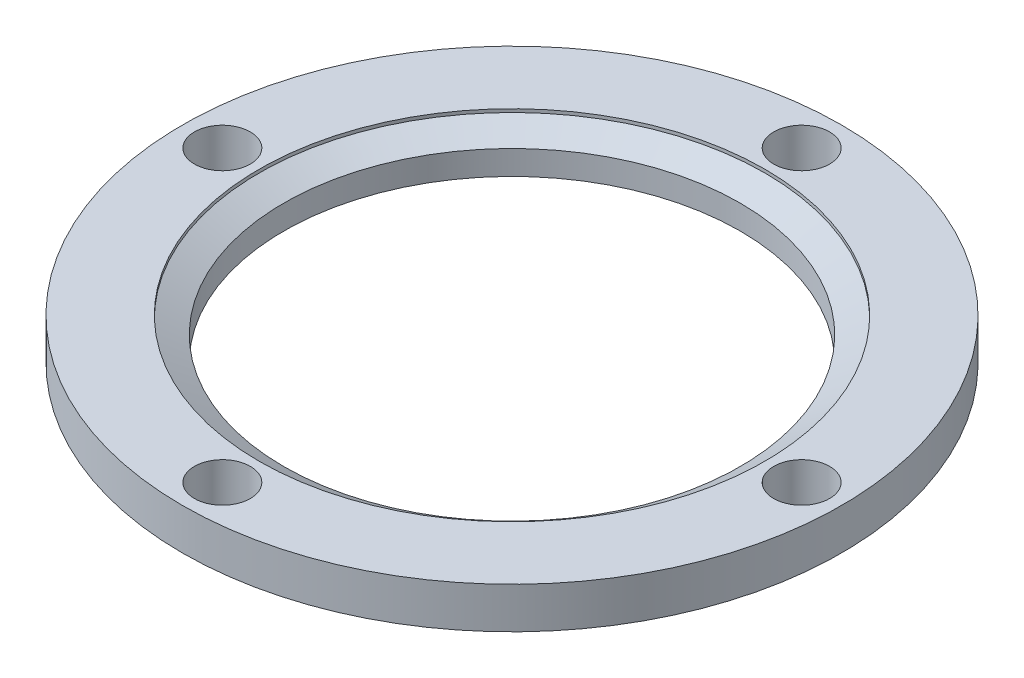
from build123d import *

# Parameters (mm, degrees)
SKETCH2_R          = 2.15265
CUT_EXTRUDE1_DEPTH = 37.061067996


with BuildPart() as part:
    # Sketch1 → Revolve1 (revolve)
    with BuildSketch(Plane.XY, mode=Mode.PRIVATE) as revolve1_sk:
        Polygon((17.5895, 0), (25.4, 0), (25.4, 3.175), (19.4945, 3.175), (19.4945, 2.921), (17.5895, 1.8669), align=None)
    revolve(revolve1_sk.sketch.rotate(Axis((0, 0, 0), (0, 1, 0)), 90), axis=Axis((0, 0, 0), (0, 1, 0)))

    # Sketch2 → Cut-Extrude1 (cut, through all)
    with BuildSketch(Plane(origin=(0, 3.175, 0), x_dir=(-1, 0, 0), z_dir=(0, 1, 0))):
        with Locations(Location((-22.32406, 0, 0), (0, 0, 90))):
            Circle(SKETCH2_R)
        with Locations(Location((0, 22.32406, 0), (0, 0, 90))):
            Circle(SKETCH2_R)
        with Locations(Location((0, -22.32406, 0), (0, 0, 270))):
            Circle(SKETCH2_R)
        with Locations(Location((22.32406, 0, 0), (0, 0, 270))):
            Circle(SKETCH2_R)
    extrude(amount=-CUT_EXTRUDE1_DEPTH, mode=Mode.SUBTRACT)


solid = part.part
